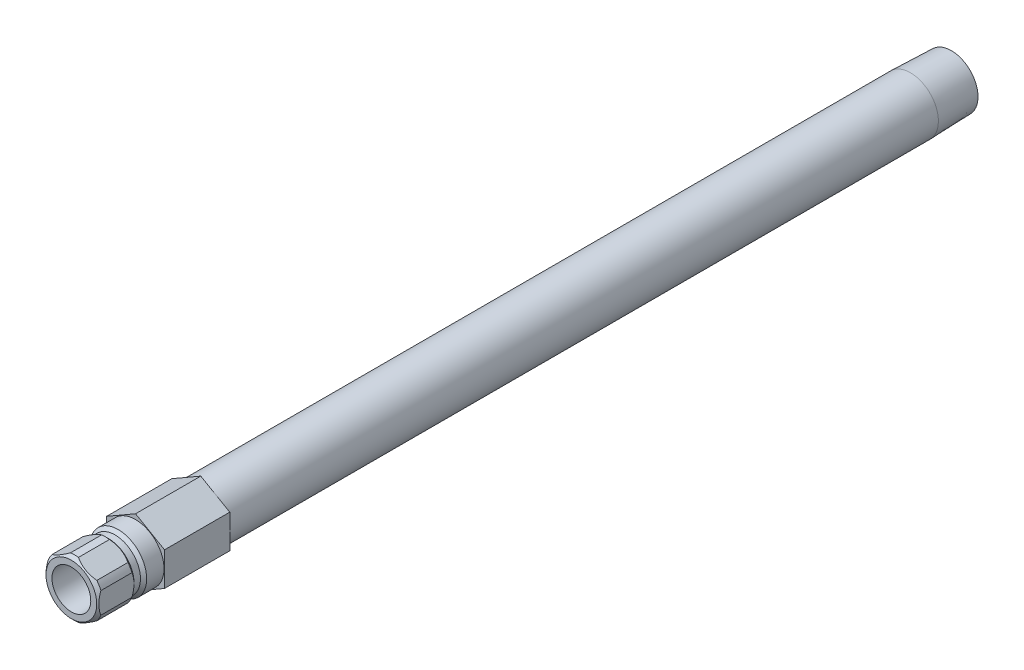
from build123d import *

# Parameters (mm, degrees)
SKETCH2_R           = 4.6228
BOSS_EXTRUDE1_DEPTH = 16.002
CUT_EXTRUDE1_START  = 6.604
SKETCH3_OUTSIDE_W   = 59.622
SKETCH3_OUTSIDE_H   = 61.822
CUT_EXTRUDE1_DEPTH  = 194.842612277


with BuildPart() as part:
    # Sketch1 → Revolve1 (revolve)
    with BuildSketch(Plane(origin=(0, 0, 0), x_dir=(0, 0, -1), z_dir=(1, 0, 0))):
        Polygon((-15.748, 4.7625), (-15.748, 6.223), (-14.986, 6.985), (-7.366, 6.985), (-6.604, 6.223), (-5.0165, 6.223), (-4.2545, 6.985), (0, 6.985), (0, 6.858), (190.119, 6.858), (200.152, 6.544470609), (200.152, 4.6228), (-3.481720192, 4.6228), (-3.556, 4.7625), align=None)
    revolve(axis=Axis((0, 0, 12.87483316), (0, 0, 1)))

    # Sketch2 → Boss-Extrude1 (add)
    with BuildSketch(Plane.XY):
        Polygon((-7.112, 4.106115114), (-7.112, -4.106115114), (0, -8.212230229), (7.112, -4.106115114), (7.112, 4.106115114), (0, 8.212230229), align=None)
        with Locations(Location((0, 0, 0), (0, 0, 90))):
            Circle(SKETCH2_R, mode=Mode.SUBTRACT)
    extrude(amount=-BOSS_EXTRUDE1_DEPTH)

    # Sketch3 outside → Cut-Extrude1 (cut, through all)
    with BuildSketch(Plane.XY.offset(CUT_EXTRUDE1_START)):
        Rectangle(SKETCH3_OUTSIDE_W, SKETCH3_OUTSIDE_H)
        Polygon((6.477, -3.739497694), (6.477, 3.739497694), (0, 7.478995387), (-6.477, 3.739497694), (-6.477, -3.739497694), (0, -7.478995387), align=None, mode=Mode.SUBTRACT)
    extrude(amount=CUT_EXTRUDE1_DEPTH, mode=Mode.SUBTRACT)


solid = part.part
